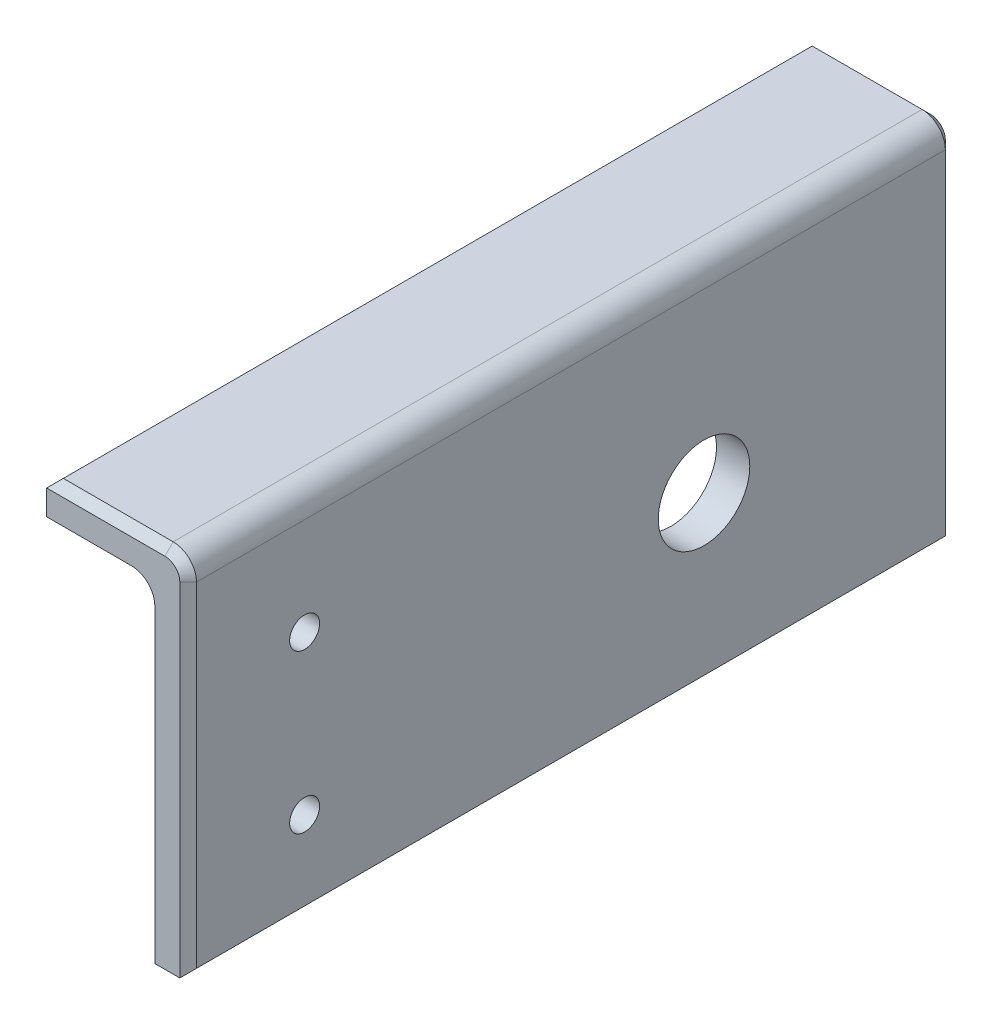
ISO-10303-21;
HEADER;
FILE_DESCRIPTION(('STEP AP214'),'2;1');
FILE_NAME('part.step','',(''),(''),'','','');
FILE_SCHEMA(('AUTOMOTIVE_DESIGN { 1 0 10303 214 1 1 1 1 }'));
ENDSEC;
DATA;
#1=APPLICATION_CONTEXT('core data for automotive mechanical design processes');
#2=APPLICATION_PROTOCOL_DEFINITION('international standard','automotive_design',2000,#1);
#3=PRODUCT_CONTEXT('',#1,'mechanical');
#4=PRODUCT('Part','Part','',(#3));
#5=PRODUCT_RELATED_PRODUCT_CATEGORY('part','',(#4));
#6=PRODUCT_DEFINITION_FORMATION('','',#4);
#7=PRODUCT_DEFINITION_CONTEXT('part definition',#1,'design');
#8=PRODUCT_DEFINITION('design','',#6,#7);
#9=PRODUCT_DEFINITION_SHAPE('','',#8);
#10=(LENGTH_UNIT() NAMED_UNIT(*) SI_UNIT(.MILLI.,.METRE.));
#11=(NAMED_UNIT(*) PLANE_ANGLE_UNIT() SI_UNIT($,.RADIAN.));
#12=(NAMED_UNIT(*) SI_UNIT($,.STERADIAN.) SOLID_ANGLE_UNIT());
#13=UNCERTAINTY_MEASURE_WITH_UNIT(LENGTH_MEASURE(1.E-05),#10,'distance_accuracy_value','');
#14=(GEOMETRIC_REPRESENTATION_CONTEXT(3) GLOBAL_UNCERTAINTY_ASSIGNED_CONTEXT((#13)) GLOBAL_UNIT_ASSIGNED_CONTEXT((#10,
#11,#12)) REPRESENTATION_CONTEXT('',''));
#15=CARTESIAN_POINT('',(0.,0.,0.));
#16=DIRECTION('',(0.,0.,1.));
#17=DIRECTION('',(1.,0.,0.));
#18=AXIS2_PLACEMENT_3D('',#15,#16,#17);
#19=CARTESIAN_POINT('',(2.,20.,0.));
#20=DIRECTION('',(0.,0.,1.));
#21=DIRECTION('',(0.,-1.,0.));
#22=AXIS2_PLACEMENT_3D('',#19,#20,#21);
#23=PLANE('',#22);
#24=CARTESIAN_POINT('',(0.6,20.6,0.));
#25=DIRECTION('',(0.,0.,1.));
#26=DIRECTION('',(0.,-1.,0.));
#27=AXIS2_PLACEMENT_3D('',#24,#25,#26);
#28=CIRCLE('',#27,0.9);
#29=CARTESIAN_POINT('',(0.6,21.5,0.));
#30=VERTEX_POINT('',#29);
#31=CARTESIAN_POINT('',(1.5,20.6,0.));
#32=VERTEX_POINT('',#31);
#33=EDGE_CURVE('E206',#30,#32,#28,.F.);
#34=ORIENTED_EDGE('',*,*,#33,.T.);
#35=DIRECTION('',(0.,-1.,0.));
#36=VECTOR('',#35,1.);
#37=CARTESIAN_POINT('',(1.5,20.,0.));
#38=LINE('',#37,#36);
#39=CARTESIAN_POINT('',(1.5,0.,0.));
#40=VERTEX_POINT('',#39);
#41=EDGE_CURVE('E208',#32,#40,#38,.T.);
#42=ORIENTED_EDGE('',*,*,#41,.T.);
#43=DIRECTION('',(-1.,0.,0.));
#44=VECTOR('',#43,1.);
#45=CARTESIAN_POINT('',(2.,0.,0.));
#46=LINE('',#45,#44);
#47=CARTESIAN_POINT('',(0.,0.,0.));
#48=VERTEX_POINT('',#47);
#49=EDGE_CURVE('E174',#40,#48,#46,.T.);
#50=ORIENTED_EDGE('',*,*,#49,.T.);
#51=DIRECTION('',(0.,1.,0.));
#52=VECTOR('',#51,1.);
#53=CARTESIAN_POINT('',(0.,20.,0.));
#54=LINE('',#53,#52);
#55=CARTESIAN_POINT('',(0.,18.6,0.));
#56=VERTEX_POINT('',#55);
#57=EDGE_CURVE('E165',#48,#56,#54,.T.);
#58=ORIENTED_EDGE('',*,*,#57,.T.);
#59=CARTESIAN_POINT('',(-1.4,18.6,0.));
#60=DIRECTION('',(0.,0.,1.));
#61=DIRECTION('',(0.,-1.,0.));
#62=AXIS2_PLACEMENT_3D('',#59,#60,#61);
#63=CIRCLE('',#62,1.4);
#64=CARTESIAN_POINT('',(-1.4,20.,0.));
#65=VERTEX_POINT('',#64);
#66=EDGE_CURVE('E144',#56,#65,#63,.T.);
#67=ORIENTED_EDGE('',*,*,#66,.T.);
#68=DIRECTION('',(-1.,0.,0.));
#69=VECTOR('',#68,1.);
#70=CARTESIAN_POINT('',(2.,20.,0.));
#71=LINE('',#70,#69);
#72=CARTESIAN_POINT('',(-6.5,20.,0.));
#73=VERTEX_POINT('',#72);
#74=EDGE_CURVE('E141',#65,#73,#71,.T.);
#75=ORIENTED_EDGE('',*,*,#74,.T.);
#76=DIRECTION('',(0.,-1.,0.));
#77=VECTOR('',#76,1.);
#78=CARTESIAN_POINT('',(-6.5,22.,0.));
#79=LINE('',#78,#77);
#80=CARTESIAN_POINT('',(-6.5,21.5,0.));
#81=VERTEX_POINT('',#80);
#82=EDGE_CURVE('E127',#81,#73,#79,.T.);
#83=ORIENTED_EDGE('',*,*,#82,.F.);
#84=DIRECTION('',(1.,0.,0.));
#85=VECTOR('',#84,1.);
#86=CARTESIAN_POINT('',(2.,21.5,0.));
#87=LINE('',#86,#85);
#88=EDGE_CURVE('E204',#81,#30,#87,.T.);
#89=ORIENTED_EDGE('',*,*,#88,.T.);
#90=EDGE_LOOP('',(#34,#42,#50,#58,#67,#75,#83,#89));
#91=FACE_BOUND('',#90,.T.);
#92=ADVANCED_FACE('F37',(#91),#23,.F.);
#93=CARTESIAN_POINT('',(2.,20.,46.));
#94=DIRECTION('',(0.,0.,-1.));
#95=DIRECTION('',(-1.,0.,0.));
#96=AXIS2_PLACEMENT_3D('',#93,#94,#95);
#97=PLANE('',#96);
#98=DIRECTION('',(-1.,0.,0.));
#99=VECTOR('',#98,1.);
#100=CARTESIAN_POINT('',(2.,0.,46.));
#101=LINE('',#100,#99);
#102=CARTESIAN_POINT('',(1.5,0.,46.));
#103=VERTEX_POINT('',#102);
#104=CARTESIAN_POINT('',(0.,0.,46.));
#105=VERTEX_POINT('',#104);
#106=EDGE_CURVE('E176',#103,#105,#101,.T.);
#107=ORIENTED_EDGE('',*,*,#106,.F.);
#108=DIRECTION('',(0.,1.,0.));
#109=VECTOR('',#108,1.);
#110=CARTESIAN_POINT('',(1.5,20.,46.));
#111=LINE('',#110,#109);
#112=CARTESIAN_POINT('',(1.5,20.6,46.));
#113=VERTEX_POINT('',#112);
#114=EDGE_CURVE('E215',#103,#113,#111,.T.);
#115=ORIENTED_EDGE('',*,*,#114,.T.);
#116=CARTESIAN_POINT('',(0.6,20.6,46.));
#117=DIRECTION('',(0.,0.,-1.));
#118=DIRECTION('',(-1.,0.,0.));
#119=AXIS2_PLACEMENT_3D('',#116,#117,#118);
#120=CIRCLE('',#119,0.899999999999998);
#121=CARTESIAN_POINT('',(0.6,21.5,46.));
#122=VERTEX_POINT('',#121);
#123=EDGE_CURVE('E213',#113,#122,#120,.F.);
#124=ORIENTED_EDGE('',*,*,#123,.T.);
#125=DIRECTION('',(-1.,0.,0.));
#126=VECTOR('',#125,1.);
#127=CARTESIAN_POINT('',(2.,21.5,46.));
#128=LINE('',#127,#126);
#129=CARTESIAN_POINT('',(-6.5,21.5,46.));
#130=VERTEX_POINT('',#129);
#131=EDGE_CURVE('E211',#122,#130,#128,.T.);
#132=ORIENTED_EDGE('',*,*,#131,.T.);
#133=DIRECTION('',(0.,-1.,0.));
#134=VECTOR('',#133,1.);
#135=CARTESIAN_POINT('',(-6.5,22.,46.));
#136=LINE('',#135,#134);
#137=CARTESIAN_POINT('',(-6.5,20.,46.));
#138=VERTEX_POINT('',#137);
#139=EDGE_CURVE('E138',#130,#138,#136,.T.);
#140=ORIENTED_EDGE('',*,*,#139,.T.);
#141=DIRECTION('',(1.,0.,0.));
#142=VECTOR('',#141,1.);
#143=CARTESIAN_POINT('',(2.,20.,46.));
#144=LINE('',#143,#142);
#145=CARTESIAN_POINT('',(-1.4,20.,46.));
#146=VERTEX_POINT('',#145);
#147=EDGE_CURVE('E151',#138,#146,#144,.T.);
#148=ORIENTED_EDGE('',*,*,#147,.T.);
#149=CARTESIAN_POINT('',(-1.4,18.6,46.));
#150=DIRECTION('',(0.,0.,-1.));
#151=DIRECTION('',(-1.,0.,0.));
#152=AXIS2_PLACEMENT_3D('',#149,#150,#151);
#153=CIRCLE('',#152,1.4);
#154=CARTESIAN_POINT('',(0.,18.6,46.));
#155=VERTEX_POINT('',#154);
#156=EDGE_CURVE('E189',#146,#155,#153,.T.);
#157=ORIENTED_EDGE('',*,*,#156,.T.);
#158=DIRECTION('',(0.,-1.,0.));
#159=VECTOR('',#158,1.);
#160=CARTESIAN_POINT('',(0.,20.,46.));
#161=LINE('',#160,#159);
#162=EDGE_CURVE('E167',#155,#105,#161,.T.);
#163=ORIENTED_EDGE('',*,*,#162,.T.);
#164=EDGE_LOOP('',(#107,#115,#124,#132,#140,#148,#157,#163));
#165=FACE_BOUND('',#164,.T.);
#166=ADVANCED_FACE('F256',(#165),#97,.F.);
#167=CARTESIAN_POINT('',(2.,0.,0.));
#168=DIRECTION('',(0.,1.,0.));
#169=DIRECTION('',(0.,0.,1.));
#170=AXIS2_PLACEMENT_3D('',#167,#168,#169);
#171=PLANE('',#170);
#172=ORIENTED_EDGE('',*,*,#49,.F.);
#173=DIRECTION('',(0.,0.,1.));
#174=VECTOR('',#173,1.);
#175=CARTESIAN_POINT('',(1.5,0.,0.));
#176=LINE('',#175,#174);
#177=EDGE_CURVE('E11',#40,#103,#176,.T.);
#178=ORIENTED_EDGE('',*,*,#177,.T.);
#179=ORIENTED_EDGE('',*,*,#106,.T.);
#180=DIRECTION('',(0.,0.,-1.));
#181=VECTOR('',#180,1.);
#182=CARTESIAN_POINT('',(0.,0.,0.));
#183=LINE('',#182,#181);
#184=EDGE_CURVE('E171',#105,#48,#183,.T.);
#185=ORIENTED_EDGE('',*,*,#184,.T.);
#186=EDGE_LOOP('',(#172,#178,#179,#185));
#187=FACE_BOUND('',#186,.T.);
#188=ADVANCED_FACE('F301',(#187),#171,.F.);
#189=CARTESIAN_POINT('',(2.,0.,0.));
#190=DIRECTION('',(-1.,0.,0.));
#191=DIRECTION('',(0.,0.,1.));
#192=AXIS2_PLACEMENT_3D('',#189,#190,#191);
#193=PLANE('',#192);
#194=CARTESIAN_POINT('',(2.,5.25,39.));
#195=DIRECTION('',(1.,0.,0.));
#196=DIRECTION('',(0.,0.,-1.));
#197=AXIS2_PLACEMENT_3D('',#194,#195,#196);
#198=CIRCLE('',#197,0.899999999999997);
#199=CARTESIAN_POINT('',(2.,5.25,38.1));
#200=VERTEX_POINT('',#199);
#201=EDGE_CURVE('E156',#200,#200,#198,.T.);
#202=ORIENTED_EDGE('',*,*,#201,.F.);
#203=EDGE_LOOP('',(#202));
#204=FACE_BOUND('',#203,.T.);
#205=CARTESIAN_POINT('',(2.,14.75,39.));
#206=DIRECTION('',(1.,0.,0.));
#207=DIRECTION('',(0.,0.,-1.));
#208=AXIS2_PLACEMENT_3D('',#205,#206,#207);
#209=CIRCLE('',#208,0.899999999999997);
#210=CARTESIAN_POINT('',(2.,14.75,38.1));
#211=VERTEX_POINT('',#210);
#212=EDGE_CURVE('E160',#211,#211,#209,.T.);
#213=ORIENTED_EDGE('',*,*,#212,.F.);
#214=EDGE_LOOP('',(#213));
#215=FACE_BOUND('',#214,.T.);
#216=CARTESIAN_POINT('',(2.,10.,15.));
#217=DIRECTION('',(1.,0.,0.));
#218=DIRECTION('',(0.,0.,-1.));
#219=AXIS2_PLACEMENT_3D('',#216,#217,#218);
#220=CIRCLE('',#219,2.75);
#221=CARTESIAN_POINT('',(2.,10.,12.25));
#222=VERTEX_POINT('',#221);
#223=EDGE_CURVE('E137',#222,#222,#220,.T.);
#224=ORIENTED_EDGE('',*,*,#223,.F.);
#225=EDGE_LOOP('',(#224));
#226=FACE_BOUND('',#225,.T.);
#227=DIRECTION('',(0.,0.,-1.));
#228=VECTOR('',#227,1.);
#229=CARTESIAN_POINT('',(2.,0.500000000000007,0.));
#230=LINE('',#229,#228);
#231=CARTESIAN_POINT('',(2.,0.500000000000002,45.5));
#232=VERTEX_POINT('',#231);
#233=CARTESIAN_POINT('',(2.,0.500000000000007,0.500000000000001));
#234=VERTEX_POINT('',#233);
#235=EDGE_CURVE('E197',#232,#234,#230,.T.);
#236=ORIENTED_EDGE('',*,*,#235,.T.);
#237=DIRECTION('',(0.,1.,0.));
#238=VECTOR('',#237,1.);
#239=CARTESIAN_POINT('',(2.,0.,0.5));
#240=LINE('',#239,#238);
#241=CARTESIAN_POINT('',(2.,20.6,0.500000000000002));
#242=VERTEX_POINT('',#241);
#243=EDGE_CURVE('E201',#234,#242,#240,.T.);
#244=ORIENTED_EDGE('',*,*,#243,.T.);
#245=DIRECTION('',(0.,0.,-1.));
#246=VECTOR('',#245,1.);
#247=CARTESIAN_POINT('',(2.,20.6,0.));
#248=LINE('',#247,#246);
#249=CARTESIAN_POINT('',(2.,20.6,45.5));
#250=VERTEX_POINT('',#249);
#251=EDGE_CURVE('E194',#242,#250,#248,.F.);
#252=ORIENTED_EDGE('',*,*,#251,.T.);
#253=DIRECTION('',(0.,-1.,0.));
#254=VECTOR('',#253,1.);
#255=CARTESIAN_POINT('',(2.,0.,45.5));
#256=LINE('',#255,#254);
#257=EDGE_CURVE('E199',#250,#232,#256,.T.);
#258=ORIENTED_EDGE('',*,*,#257,.T.);
#259=EDGE_LOOP('',(#236,#244,#252,#258));
#260=FACE_BOUND('',#259,.T.);
#261=ADVANCED_FACE('F269',(#204,#215,#226,#260),#193,.F.);
#262=CARTESIAN_POINT('',(0.,0.,0.));
#263=DIRECTION('',(-1.,0.,0.));
#264=DIRECTION('',(0.,0.,1.));
#265=AXIS2_PLACEMENT_3D('',#262,#263,#264);
#266=PLANE('',#265);
#267=CARTESIAN_POINT('',(0.,5.25,39.));
#268=DIRECTION('',(-1.,0.,0.));
#269=DIRECTION('',(0.,0.,1.));
#270=AXIS2_PLACEMENT_3D('',#267,#268,#269);
#271=CIRCLE('',#270,0.899999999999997);
#272=CARTESIAN_POINT('',(0.,5.25,39.9));
#273=VERTEX_POINT('',#272);
#274=EDGE_CURVE('E168',#273,#273,#271,.T.);
#275=ORIENTED_EDGE('',*,*,#274,.F.);
#276=EDGE_LOOP('',(#275));
#277=FACE_BOUND('',#276,.T.);
#278=CARTESIAN_POINT('',(0.,14.75,39.));
#279=DIRECTION('',(-1.,0.,0.));
#280=DIRECTION('',(0.,0.,1.));
#281=AXIS2_PLACEMENT_3D('',#278,#279,#280);
#282=CIRCLE('',#281,0.899999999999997);
#283=CARTESIAN_POINT('',(0.,14.75,39.9));
#284=VERTEX_POINT('',#283);
#285=EDGE_CURVE('E181',#284,#284,#282,.T.);
#286=ORIENTED_EDGE('',*,*,#285,.F.);
#287=EDGE_LOOP('',(#286));
#288=FACE_BOUND('',#287,.T.);
#289=CARTESIAN_POINT('',(0.,10.,15.));
#290=DIRECTION('',(-1.,0.,0.));
#291=DIRECTION('',(0.,0.,1.));
#292=AXIS2_PLACEMENT_3D('',#289,#290,#291);
#293=CIRCLE('',#292,2.75);
#294=CARTESIAN_POINT('',(0.,10.,17.75));
#295=VERTEX_POINT('',#294);
#296=EDGE_CURVE('E159',#295,#295,#293,.T.);
#297=ORIENTED_EDGE('',*,*,#296,.F.);
#298=EDGE_LOOP('',(#297));
#299=FACE_BOUND('',#298,.T.);
#300=ORIENTED_EDGE('',*,*,#162,.F.);
#301=DIRECTION('',(0.,0.,1.));
#302=VECTOR('',#301,1.);
#303=CARTESIAN_POINT('',(0.,18.6,0.));
#304=LINE('',#303,#302);
#305=EDGE_CURVE('E187',#155,#56,#304,.F.);
#306=ORIENTED_EDGE('',*,*,#305,.T.);
#307=ORIENTED_EDGE('',*,*,#57,.F.);
#308=ORIENTED_EDGE('',*,*,#184,.F.);
#309=EDGE_LOOP('',(#300,#306,#307,#308));
#310=FACE_BOUND('',#309,.T.);
#311=ADVANCED_FACE('F425',(#277,#288,#299,#310),#266,.T.);
#312=CARTESIAN_POINT('',(-8.,10.,15.));
#313=DIRECTION('',(1.,0.,0.));
#314=DIRECTION('',(0.,0.,-1.));
#315=AXIS2_PLACEMENT_3D('',#312,#313,#314);
#316=CYLINDRICAL_SURFACE('',#315,2.75);
#317=ORIENTED_EDGE('',*,*,#296,.T.);
#318=EDGE_LOOP('',(#317));
#319=FACE_BOUND('',#318,.T.);
#320=ORIENTED_EDGE('',*,*,#223,.T.);
#321=EDGE_LOOP('',(#320));
#322=FACE_BOUND('',#321,.T.);
#323=ADVANCED_FACE('F463',(#319,#322),#316,.F.);
#324=CARTESIAN_POINT('',(-8.,14.75,39.));
#325=DIRECTION('',(1.,0.,0.));
#326=DIRECTION('',(0.,0.,-1.));
#327=AXIS2_PLACEMENT_3D('',#324,#325,#326);
#328=CYLINDRICAL_SURFACE('',#327,0.899999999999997);
#329=ORIENTED_EDGE('',*,*,#285,.T.);
#330=EDGE_LOOP('',(#329));
#331=FACE_BOUND('',#330,.T.);
#332=ORIENTED_EDGE('',*,*,#212,.T.);
#333=EDGE_LOOP('',(#332));
#334=FACE_BOUND('',#333,.T.);
#335=ADVANCED_FACE('F454',(#331,#334),#328,.F.);
#336=CARTESIAN_POINT('',(-8.,5.25,39.));
#337=DIRECTION('',(1.,0.,0.));
#338=DIRECTION('',(0.,0.,-1.));
#339=AXIS2_PLACEMENT_3D('',#336,#337,#338);
#340=CYLINDRICAL_SURFACE('',#339,0.899999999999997);
#341=ORIENTED_EDGE('',*,*,#274,.T.);
#342=EDGE_LOOP('',(#341));
#343=FACE_BOUND('',#342,.T.);
#344=ORIENTED_EDGE('',*,*,#201,.T.);
#345=EDGE_LOOP('',(#344));
#346=FACE_BOUND('',#345,.T.);
#347=ADVANCED_FACE('F416',(#343,#346),#340,.F.);
#348=CARTESIAN_POINT('',(-6.5,22.,0.));
#349=DIRECTION('',(1.,0.,0.));
#350=DIRECTION('',(0.,0.,-1.));
#351=AXIS2_PLACEMENT_3D('',#348,#349,#350);
#352=PLANE('',#351);
#353=ORIENTED_EDGE('',*,*,#139,.F.);
#354=DIRECTION('',(0.,0.,-1.));
#355=VECTOR('',#354,1.);
#356=CARTESIAN_POINT('',(-6.5,21.5,0.));
#357=LINE('',#356,#355);
#358=EDGE_CURVE('E47',#130,#81,#357,.T.);
#359=ORIENTED_EDGE('',*,*,#358,.T.);
#360=ORIENTED_EDGE('',*,*,#82,.T.);
#361=DIRECTION('',(0.,0.,1.));
#362=VECTOR('',#361,1.);
#363=CARTESIAN_POINT('',(-6.5,20.,0.));
#364=LINE('',#363,#362);
#365=EDGE_CURVE('E132',#73,#138,#364,.T.);
#366=ORIENTED_EDGE('',*,*,#365,.T.);
#367=EDGE_LOOP('',(#353,#359,#360,#366));
#368=FACE_BOUND('',#367,.T.);
#369=ADVANCED_FACE('F130',(#368),#352,.F.);
#370=CARTESIAN_POINT('',(0.,22.,0.));
#371=DIRECTION('',(0.,-1.,0.));
#372=DIRECTION('',(0.,0.,-1.));
#373=AXIS2_PLACEMENT_3D('',#370,#371,#372);
#374=PLANE('',#373);
#375=DIRECTION('',(0.,0.,-1.));
#376=VECTOR('',#375,1.);
#377=CARTESIAN_POINT('',(0.6,22.,0.));
#378=LINE('',#377,#376);
#379=CARTESIAN_POINT('',(0.6,22.,45.5));
#380=VERTEX_POINT('',#379);
#381=CARTESIAN_POINT('',(0.6,22.,0.500000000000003));
#382=VERTEX_POINT('',#381);
#383=EDGE_CURVE('E192',#380,#382,#378,.T.);
#384=ORIENTED_EDGE('',*,*,#383,.T.);
#385=DIRECTION('',(-1.,0.,0.));
#386=VECTOR('',#385,1.);
#387=CARTESIAN_POINT('',(0.,22.,0.500000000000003));
#388=LINE('',#387,#386);
#389=CARTESIAN_POINT('',(-6.,22.,0.500000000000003));
#390=VERTEX_POINT('',#389);
#391=EDGE_CURVE('E55',#382,#390,#388,.T.);
#392=ORIENTED_EDGE('',*,*,#391,.T.);
#393=DIRECTION('',(0.,0.,1.));
#394=VECTOR('',#393,1.);
#395=CARTESIAN_POINT('',(-6.,22.,0.));
#396=LINE('',#395,#394);
#397=CARTESIAN_POINT('',(-5.99999999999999,22.,45.5));
#398=VERTEX_POINT('',#397);
#399=EDGE_CURVE('E59',#390,#398,#396,.T.);
#400=ORIENTED_EDGE('',*,*,#399,.T.);
#401=DIRECTION('',(1.,0.,0.));
#402=VECTOR('',#401,1.);
#403=CARTESIAN_POINT('',(0.,22.,45.5));
#404=LINE('',#403,#402);
#405=EDGE_CURVE('E221',#398,#380,#404,.T.);
#406=ORIENTED_EDGE('',*,*,#405,.T.);
#407=EDGE_LOOP('',(#384,#392,#400,#406));
#408=FACE_BOUND('',#407,.T.);
#409=ADVANCED_FACE('F275',(#408),#374,.F.);
#410=CARTESIAN_POINT('',(0.,20.,0.));
#411=DIRECTION('',(0.,-1.,0.));
#412=DIRECTION('',(0.,0.,-1.));
#413=AXIS2_PLACEMENT_3D('',#410,#411,#412);
#414=PLANE('',#413);
#415=ORIENTED_EDGE('',*,*,#74,.F.);
#416=DIRECTION('',(0.,0.,1.));
#417=VECTOR('',#416,1.);
#418=CARTESIAN_POINT('',(-1.4,20.,46.));
#419=LINE('',#418,#417);
#420=EDGE_CURVE('E178',#65,#146,#419,.T.);
#421=ORIENTED_EDGE('',*,*,#420,.T.);
#422=ORIENTED_EDGE('',*,*,#147,.F.);
#423=ORIENTED_EDGE('',*,*,#365,.F.);
#424=EDGE_LOOP('',(#415,#421,#422,#423));
#425=FACE_BOUND('',#424,.T.);
#426=ADVANCED_FACE('F149',(#425),#414,.T.);
#427=CARTESIAN_POINT('',(-1.4,18.6,0.));
#428=DIRECTION('',(0.,0.,-1.));
#429=DIRECTION('',(0.,1.,0.));
#430=AXIS2_PLACEMENT_3D('',#427,#428,#429);
#431=CYLINDRICAL_SURFACE('',#430,1.4);
#432=ORIENTED_EDGE('',*,*,#66,.F.);
#433=ORIENTED_EDGE('',*,*,#305,.F.);
#434=ORIENTED_EDGE('',*,*,#156,.F.);
#435=ORIENTED_EDGE('',*,*,#420,.F.);
#436=EDGE_LOOP('',(#432,#433,#434,#435));
#437=FACE_BOUND('',#436,.T.);
#438=ADVANCED_FACE('F305',(#437),#431,.F.);
#439=CARTESIAN_POINT('',(0.6,20.6,0.));
#440=DIRECTION('',(0.,0.,-1.));
#441=DIRECTION('',(0.,1.,0.));
#442=AXIS2_PLACEMENT_3D('',#439,#440,#441);
#443=CYLINDRICAL_SURFACE('',#442,1.4);
#444=ORIENTED_EDGE('',*,*,#251,.F.);
#445=CARTESIAN_POINT('',(0.6,20.6,0.500000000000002));
#446=DIRECTION('',(0.,0.,1.));
#447=DIRECTION('',(1.,0.,0.));
#448=AXIS2_PLACEMENT_3D('',#445,#446,#447);
#449=CIRCLE('',#448,1.4);
#450=EDGE_CURVE('E219',#242,#382,#449,.T.);
#451=ORIENTED_EDGE('',*,*,#450,.T.);
#452=ORIENTED_EDGE('',*,*,#383,.F.);
#453=CARTESIAN_POINT('',(0.6,20.6,45.5));
#454=DIRECTION('',(0.,0.,-1.));
#455=DIRECTION('',(-1.,0.,0.));
#456=AXIS2_PLACEMENT_3D('',#453,#454,#455);
#457=CIRCLE('',#456,1.4);
#458=EDGE_CURVE('E217',#380,#250,#457,.T.);
#459=ORIENTED_EDGE('',*,*,#458,.T.);
#460=EDGE_LOOP('',(#444,#451,#452,#459));
#461=FACE_BOUND('',#460,.T.);
#462=ADVANCED_FACE('F272',(#461),#443,.T.);
#463=CARTESIAN_POINT('',(0.,22.,45.5));
#464=DIRECTION('',(0.,-0.707106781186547,-0.707106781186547));
#465=DIRECTION('',(1.,0.,0.));
#466=AXIS2_PLACEMENT_3D('',#463,#464,#465);
#467=PLANE('',#466);
#468=DIRECTION('',(-0.577350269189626,-0.577350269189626,0.577350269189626));
#469=VECTOR('',#468,1.);
#470=CARTESIAN_POINT('',(-4.,24.,43.5));
#471=LINE('',#470,#469);
#472=EDGE_CURVE('E241',#130,#398,#471,.F.);
#473=ORIENTED_EDGE('',*,*,#472,.F.);
#474=ORIENTED_EDGE('',*,*,#131,.F.);
#475=DIRECTION('',(0.,-0.707106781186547,0.707106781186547));
#476=VECTOR('',#475,1.);
#477=CARTESIAN_POINT('',(0.6,22.,45.5));
#478=LINE('',#477,#476);
#479=EDGE_CURVE('E42',#380,#122,#478,.T.);
#480=ORIENTED_EDGE('',*,*,#479,.F.);
#481=ORIENTED_EDGE('',*,*,#405,.F.);
#482=EDGE_LOOP('',(#473,#474,#480,#481));
#483=FACE_BOUND('',#482,.T.);
#484=ADVANCED_FACE('F40',(#483),#467,.F.);
#485=CARTESIAN_POINT('',(0.6,20.6,46.));
#486=DIRECTION('',(0.,0.,-1.));
#487=DIRECTION('',(-1.,0.,0.));
#488=AXIS2_PLACEMENT_3D('',#485,#486,#487);
#489=CONICAL_SURFACE('',#488,0.899999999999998,0.78539816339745);
#490=ORIENTED_EDGE('',*,*,#479,.T.);
#491=ORIENTED_EDGE('',*,*,#123,.F.);
#492=DIRECTION('',(-0.707106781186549,0.,0.707106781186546));
#493=VECTOR('',#492,1.);
#494=CARTESIAN_POINT('',(2.,20.6,45.5));
#495=LINE('',#494,#493);
#496=EDGE_CURVE('E239',#250,#113,#495,.T.);
#497=ORIENTED_EDGE('',*,*,#496,.F.);
#498=ORIENTED_EDGE('',*,*,#458,.F.);
#499=EDGE_LOOP('',(#490,#491,#497,#498));
#500=FACE_BOUND('',#499,.T.);
#501=ADVANCED_FACE('F250',(#500),#489,.T.);
#502=CARTESIAN_POINT('',(-6.,22.,0.));
#503=DIRECTION('',(0.707106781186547,-0.707106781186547,0.));
#504=DIRECTION('',(0.,0.,1.));
#505=AXIS2_PLACEMENT_3D('',#502,#503,#504);
#506=PLANE('',#505);
#507=ORIENTED_EDGE('',*,*,#472,.T.);
#508=ORIENTED_EDGE('',*,*,#399,.F.);
#509=DIRECTION('',(-0.577350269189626,-0.577350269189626,-0.577350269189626));
#510=VECTOR('',#509,1.);
#511=CARTESIAN_POINT('',(-6.16666666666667,21.8333333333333,0.333333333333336));
#512=LINE('',#511,#510);
#513=EDGE_CURVE('E236',#81,#390,#512,.F.);
#514=ORIENTED_EDGE('',*,*,#513,.F.);
#515=ORIENTED_EDGE('',*,*,#358,.F.);
#516=EDGE_LOOP('',(#507,#508,#514,#515));
#517=FACE_BOUND('',#516,.T.);
#518=ADVANCED_FACE('F315',(#517),#506,.F.);
#519=CARTESIAN_POINT('',(2.,0.,45.5));
#520=DIRECTION('',(-0.707106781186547,0.,-0.707106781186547));
#521=DIRECTION('',(0.,-1.,0.));
#522=AXIS2_PLACEMENT_3D('',#519,#520,#521);
#523=PLANE('',#522);
#524=ORIENTED_EDGE('',*,*,#496,.T.);
#525=ORIENTED_EDGE('',*,*,#114,.F.);
#526=DIRECTION('',(-0.577350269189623,-0.577350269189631,0.577350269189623));
#527=VECTOR('',#526,1.);
#528=CARTESIAN_POINT('',(17.1666666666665,15.6666666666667,30.3333333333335));
#529=LINE('',#528,#527);
#530=EDGE_CURVE('E233',#232,#103,#529,.T.);
#531=ORIENTED_EDGE('',*,*,#530,.F.);
#532=ORIENTED_EDGE('',*,*,#257,.F.);
#533=EDGE_LOOP('',(#524,#525,#531,#532));
#534=FACE_BOUND('',#533,.T.);
#535=ADVANCED_FACE('F260',(#534),#523,.F.);
#536=CARTESIAN_POINT('',(0.,22.,0.500000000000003));
#537=DIRECTION('',(0.,-0.707106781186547,0.707106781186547));
#538=DIRECTION('',(-1.,0.,0.));
#539=AXIS2_PLACEMENT_3D('',#536,#537,#538);
#540=PLANE('',#539);
#541=ORIENTED_EDGE('',*,*,#513,.T.);
#542=ORIENTED_EDGE('',*,*,#391,.F.);
#543=DIRECTION('',(0.,0.707106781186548,0.707106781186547));
#544=VECTOR('',#543,1.);
#545=CARTESIAN_POINT('',(0.6,21.5,0.));
#546=LINE('',#545,#544);
#547=EDGE_CURVE('E230',#30,#382,#546,.T.);
#548=ORIENTED_EDGE('',*,*,#547,.F.);
#549=ORIENTED_EDGE('',*,*,#88,.F.);
#550=EDGE_LOOP('',(#541,#542,#548,#549));
#551=FACE_BOUND('',#550,.T.);
#552=ADVANCED_FACE('F278',(#551),#540,.F.);
#553=CARTESIAN_POINT('',(2.,0.500000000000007,0.));
#554=DIRECTION('',(-0.707106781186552,0.707106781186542,0.));
#555=DIRECTION('',(0.,0.,-1.));
#556=AXIS2_PLACEMENT_3D('',#553,#554,#555);
#557=PLANE('',#556);
#558=ORIENTED_EDGE('',*,*,#530,.T.);
#559=ORIENTED_EDGE('',*,*,#177,.F.);
#560=DIRECTION('',(0.577350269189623,0.577350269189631,0.577350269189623));
#561=VECTOR('',#560,1.);
#562=CARTESIAN_POINT('',(1.83333333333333,0.33333333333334,0.333333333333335));
#563=LINE('',#562,#561);
#564=EDGE_CURVE('E228',#234,#40,#563,.F.);
#565=ORIENTED_EDGE('',*,*,#564,.F.);
#566=ORIENTED_EDGE('',*,*,#235,.F.);
#567=EDGE_LOOP('',(#558,#559,#565,#566));
#568=FACE_BOUND('',#567,.T.);
#569=ADVANCED_FACE('F265',(#568),#557,.F.);
#570=CARTESIAN_POINT('',(0.6,20.6,0.));
#571=DIRECTION('',(0.,0.,1.));
#572=DIRECTION('',(1.,0.,0.));
#573=AXIS2_PLACEMENT_3D('',#570,#571,#572);
#574=CONICAL_SURFACE('',#573,0.9,0.785398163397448);
#575=ORIENTED_EDGE('',*,*,#547,.T.);
#576=ORIENTED_EDGE('',*,*,#450,.F.);
#577=DIRECTION('',(0.707106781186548,0.,0.707106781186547));
#578=VECTOR('',#577,1.);
#579=CARTESIAN_POINT('',(1.5,20.6,0.));
#580=LINE('',#579,#578);
#581=EDGE_CURVE('E226',#32,#242,#580,.T.);
#582=ORIENTED_EDGE('',*,*,#581,.F.);
#583=ORIENTED_EDGE('',*,*,#33,.F.);
#584=EDGE_LOOP('',(#575,#576,#582,#583));
#585=FACE_BOUND('',#584,.T.);
#586=ADVANCED_FACE('F282',(#585),#574,.T.);
#587=CARTESIAN_POINT('',(2.,0.,0.5));
#588=DIRECTION('',(-0.707106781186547,0.,0.707106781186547));
#589=DIRECTION('',(0.,1.,0.));
#590=AXIS2_PLACEMENT_3D('',#587,#588,#589);
#591=PLANE('',#590);
#592=ORIENTED_EDGE('',*,*,#564,.T.);
#593=ORIENTED_EDGE('',*,*,#41,.F.);
#594=ORIENTED_EDGE('',*,*,#581,.T.);
#595=ORIENTED_EDGE('',*,*,#243,.F.);
#596=EDGE_LOOP('',(#592,#593,#594,#595));
#597=FACE_BOUND('',#596,.T.);
#598=ADVANCED_FACE('F287',(#597),#591,.F.);
#599=CLOSED_SHELL('',(#92,#166,#188,#261,#311,#323,#335,#347,#369,#409,#426,#438,#462,#484,#501,
#518,#535,#552,#569,#586,#598));
#600=MANIFOLD_SOLID_BREP('B2',#599);
#601=ADVANCED_BREP_SHAPE_REPRESENTATION('',(#18,#600),#14);
#602=SHAPE_DEFINITION_REPRESENTATION(#9,#601);
ENDSEC;
END-ISO-10303-21;
